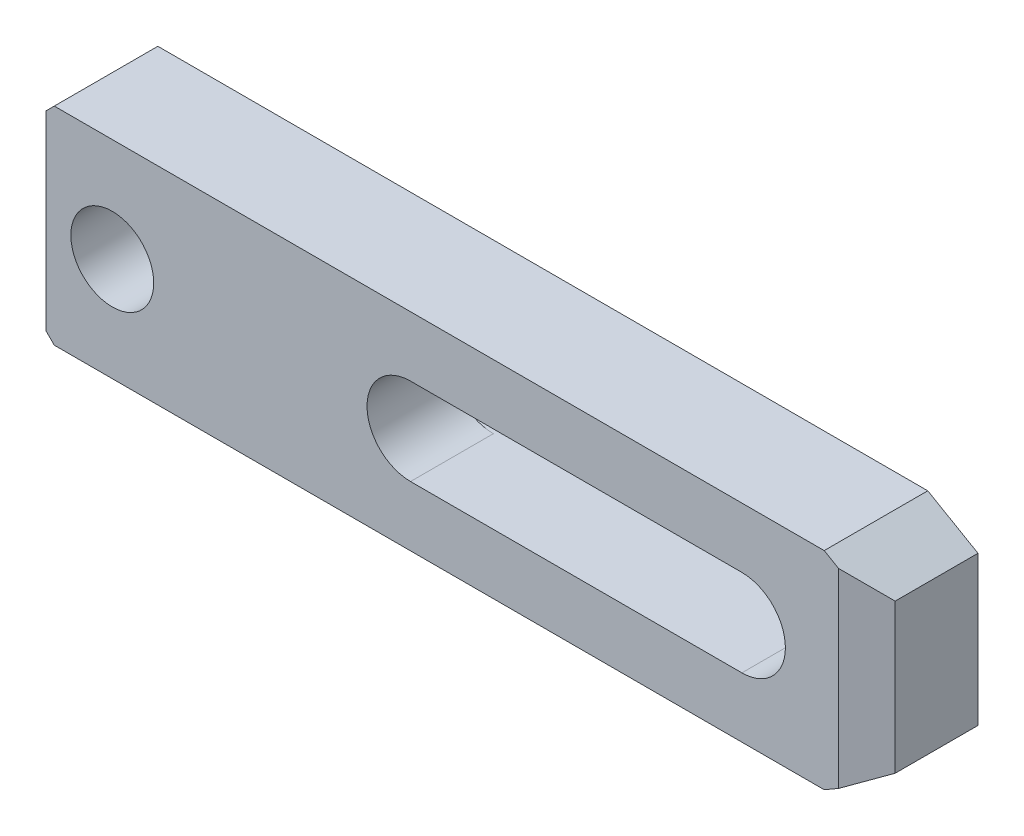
ISO-10303-21;
HEADER;
FILE_DESCRIPTION(('STEP AP214'),'2;1');
FILE_NAME('part.step','',(''),(''),'','','');
FILE_SCHEMA(('AUTOMOTIVE_DESIGN { 1 0 10303 214 1 1 1 1 }'));
ENDSEC;
DATA;
#1=APPLICATION_CONTEXT('core data for automotive mechanical design processes');
#2=APPLICATION_PROTOCOL_DEFINITION('international standard','automotive_design',2000,#1);
#3=PRODUCT_CONTEXT('',#1,'mechanical');
#4=PRODUCT('Part','Part','',(#3));
#5=PRODUCT_RELATED_PRODUCT_CATEGORY('part','',(#4));
#6=PRODUCT_DEFINITION_FORMATION('','',#4);
#7=PRODUCT_DEFINITION_CONTEXT('part definition',#1,'design');
#8=PRODUCT_DEFINITION('design','',#6,#7);
#9=PRODUCT_DEFINITION_SHAPE('','',#8);
#10=(LENGTH_UNIT() NAMED_UNIT(*) SI_UNIT(.MILLI.,.METRE.));
#11=(NAMED_UNIT(*) PLANE_ANGLE_UNIT() SI_UNIT($,.RADIAN.));
#12=(NAMED_UNIT(*) SI_UNIT($,.STERADIAN.) SOLID_ANGLE_UNIT());
#13=UNCERTAINTY_MEASURE_WITH_UNIT(LENGTH_MEASURE(1.E-05),#10,'distance_accuracy_value','');
#14=(GEOMETRIC_REPRESENTATION_CONTEXT(3) GLOBAL_UNCERTAINTY_ASSIGNED_CONTEXT((#13)) GLOBAL_UNIT_ASSIGNED_CONTEXT((#10,
#11,#12)) REPRESENTATION_CONTEXT('',''));
#15=CARTESIAN_POINT('',(0.,0.,0.));
#16=DIRECTION('',(0.,0.,1.));
#17=DIRECTION('',(1.,0.,0.));
#18=AXIS2_PLACEMENT_3D('',#15,#16,#17);
#19=CARTESIAN_POINT('',(-97.9647922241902,93.0352077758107,0.));
#20=DIRECTION('',(0.,0.,1.));
#21=DIRECTION('',(-1.,0.,0.));
#22=AXIS2_PLACEMENT_3D('',#19,#20,#21);
#23=PLANE('',#22);
#24=DIRECTION('',(0.,1.,0.));
#25=VECTOR('',#24,1.);
#26=CARTESIAN_POINT('',(-168.,-23.,0.));
#27=LINE('',#26,#25);
#28=CARTESIAN_POINT('',(-168.,-23.,0.));
#29=VERTEX_POINT('',#28);
#30=CARTESIAN_POINT('',(-168.,-10.5,0.));
#31=VERTEX_POINT('',#30);
#32=EDGE_CURVE('E147',#29,#31,#27,.T.);
#33=ORIENTED_EDGE('',*,*,#32,.T.);
#34=DIRECTION('',(-1.,0.,0.));
#35=VECTOR('',#34,1.);
#36=CARTESIAN_POINT('',(0.,-10.5,0.));
#37=LINE('',#36,#35);
#38=CARTESIAN_POINT('',(0.,-10.5,0.));
#39=VERTEX_POINT('',#38);
#40=EDGE_CURVE('E237',#39,#31,#37,.T.);
#41=ORIENTED_EDGE('',*,*,#40,.F.);
#42=CARTESIAN_POINT('',(0.,0.,0.));
#43=DIRECTION('',(0.,0.,1.));
#44=DIRECTION('',(-1.,0.,0.));
#45=AXIS2_PLACEMENT_3D('',#42,#43,#44);
#46=CIRCLE('',#45,10.5);
#47=CARTESIAN_POINT('',(0.,10.5,0.));
#48=VERTEX_POINT('',#47);
#49=EDGE_CURVE('E128',#39,#48,#46,.T.);
#50=ORIENTED_EDGE('',*,*,#49,.T.);
#51=DIRECTION('',(1.,0.,0.));
#52=VECTOR('',#51,1.);
#53=CARTESIAN_POINT('',(-80.,10.5,0.));
#54=LINE('',#53,#52);
#55=CARTESIAN_POINT('',(-168.,10.5,0.));
#56=VERTEX_POINT('',#55);
#57=EDGE_CURVE('E119',#56,#48,#54,.T.);
#58=ORIENTED_EDGE('',*,*,#57,.F.);
#59=CARTESIAN_POINT('',(-168.,23.,0.));
#60=VERTEX_POINT('',#59);
#61=EDGE_CURVE('E124',#56,#60,#27,.T.);
#62=ORIENTED_EDGE('',*,*,#61,.T.);
#63=DIRECTION('',(-0.707106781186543,-0.707106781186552,0.));
#64=VECTOR('',#63,1.);
#65=CARTESIAN_POINT('',(-166.,25.,0.));
#66=LINE('',#65,#64);
#67=CARTESIAN_POINT('',(-166.,25.,0.));
#68=VERTEX_POINT('',#67);
#69=EDGE_CURVE('E148',#68,#60,#66,.T.);
#70=ORIENTED_EDGE('',*,*,#69,.F.);
#71=DIRECTION('',(-1.,0.,0.));
#72=VECTOR('',#71,1.);
#73=CARTESIAN_POINT('',(19.875644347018,25.,0.));
#74=LINE('',#73,#72);
#75=CARTESIAN_POINT('',(19.875644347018,25.,0.));
#76=VERTEX_POINT('',#75);
#77=EDGE_CURVE('E151',#76,#68,#74,.T.);
#78=ORIENTED_EDGE('',*,*,#77,.F.);
#79=DIRECTION('',(-0.866025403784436,0.5,0.));
#80=VECTOR('',#79,1.);
#81=CARTESIAN_POINT('',(32.,18.,0.));
#82=LINE('',#81,#80);
#83=CARTESIAN_POINT('',(32.,18.,0.));
#84=VERTEX_POINT('',#83);
#85=EDGE_CURVE('E158',#84,#76,#82,.T.);
#86=ORIENTED_EDGE('',*,*,#85,.F.);
#87=DIRECTION('',(0.,-1.,0.));
#88=VECTOR('',#87,1.);
#89=CARTESIAN_POINT('',(32.,18.,0.));
#90=LINE('',#89,#88);
#91=CARTESIAN_POINT('',(32.,-18.,0.));
#92=VERTEX_POINT('',#91);
#93=EDGE_CURVE('E181',#84,#92,#90,.T.);
#94=ORIENTED_EDGE('',*,*,#93,.T.);
#95=DIRECTION('',(-0.86602540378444,-0.5,0.));
#96=VECTOR('',#95,1.);
#97=CARTESIAN_POINT('',(32.,-18.,0.));
#98=LINE('',#97,#96);
#99=CARTESIAN_POINT('',(19.8756443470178,-25.,0.));
#100=VERTEX_POINT('',#99);
#101=EDGE_CURVE('E208',#92,#100,#98,.T.);
#102=ORIENTED_EDGE('',*,*,#101,.T.);
#103=DIRECTION('',(-1.,0.,0.));
#104=VECTOR('',#103,1.);
#105=CARTESIAN_POINT('',(19.8756443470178,-25.,0.));
#106=LINE('',#105,#104);
#107=CARTESIAN_POINT('',(-166.,-25.,0.));
#108=VERTEX_POINT('',#107);
#109=EDGE_CURVE('E210',#100,#108,#106,.T.);
#110=ORIENTED_EDGE('',*,*,#109,.T.);
#111=DIRECTION('',(-0.707106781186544,0.707106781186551,0.));
#112=VECTOR('',#111,1.);
#113=CARTESIAN_POINT('',(-166.,-25.,0.));
#114=LINE('',#113,#112);
#115=EDGE_CURVE('E150',#108,#29,#114,.T.);
#116=ORIENTED_EDGE('',*,*,#115,.T.);
#117=EDGE_LOOP('',(#33,#41,#50,#58,#62,#70,#78,#86,#94,#102,#110,#116));
#118=FACE_BOUND('',#117,.T.);
#119=ADVANCED_FACE('F14',(#118),#23,.F.);
#120=CARTESIAN_POINT('',(-168.,-23.,25.));
#121=DIRECTION('',(-1.,0.,0.));
#122=DIRECTION('',(0.,0.,-1.));
#123=AXIS2_PLACEMENT_3D('',#120,#121,#122);
#124=PLANE('',#123);
#125=DIRECTION('',(0.,-1.,0.));
#126=VECTOR('',#125,1.);
#127=CARTESIAN_POINT('',(-168.,-23.,5.));
#128=LINE('',#127,#126);
#129=CARTESIAN_POINT('',(-168.,10.5,5.));
#130=VERTEX_POINT('',#129);
#131=CARTESIAN_POINT('',(-168.,-10.5,5.));
#132=VERTEX_POINT('',#131);
#133=EDGE_CURVE('E141',#130,#132,#128,.T.);
#134=ORIENTED_EDGE('',*,*,#133,.T.);
#135=DIRECTION('',(0.,0.,-1.));
#136=VECTOR('',#135,1.);
#137=CARTESIAN_POINT('',(-168.,-10.5,25.));
#138=LINE('',#137,#136);
#139=EDGE_CURVE('E140',#132,#31,#138,.T.);
#140=ORIENTED_EDGE('',*,*,#139,.T.);
#141=ORIENTED_EDGE('',*,*,#32,.F.);
#142=DIRECTION('',(0.,0.,-1.));
#143=VECTOR('',#142,1.);
#144=CARTESIAN_POINT('',(-168.,-23.,25.));
#145=LINE('',#144,#143);
#146=CARTESIAN_POINT('',(-168.,-23.,25.));
#147=VERTEX_POINT('',#146);
#148=EDGE_CURVE('E189',#147,#29,#145,.T.);
#149=ORIENTED_EDGE('',*,*,#148,.F.);
#150=DIRECTION('',(0.,1.,0.));
#151=VECTOR('',#150,1.);
#152=CARTESIAN_POINT('',(-168.,-23.,25.));
#153=LINE('',#152,#151);
#154=CARTESIAN_POINT('',(-168.,23.,25.));
#155=VERTEX_POINT('',#154);
#156=EDGE_CURVE('E171',#147,#155,#153,.T.);
#157=ORIENTED_EDGE('',*,*,#156,.T.);
#158=DIRECTION('',(0.,0.,-1.));
#159=VECTOR('',#158,1.);
#160=CARTESIAN_POINT('',(-168.,23.,25.));
#161=LINE('',#160,#159);
#162=EDGE_CURVE('E145',#155,#60,#161,.T.);
#163=ORIENTED_EDGE('',*,*,#162,.T.);
#164=ORIENTED_EDGE('',*,*,#61,.F.);
#165=DIRECTION('',(0.,0.,-1.));
#166=VECTOR('',#165,1.);
#167=CARTESIAN_POINT('',(-168.,10.5,25.));
#168=LINE('',#167,#166);
#169=EDGE_CURVE('E135',#130,#56,#168,.T.);
#170=ORIENTED_EDGE('',*,*,#169,.F.);
#171=EDGE_LOOP('',(#134,#140,#141,#149,#157,#163,#164,#170));
#172=FACE_BOUND('',#171,.T.);
#173=ADVANCED_FACE('F143',(#172),#124,.T.);
#174=CARTESIAN_POINT('',(-152.,0.,25.));
#175=DIRECTION('',(0.,0.,-1.));
#176=DIRECTION('',(1.,0.,0.));
#177=AXIS2_PLACEMENT_3D('',#174,#175,#176);
#178=CYLINDRICAL_SURFACE('',#177,10.);
#179=CARTESIAN_POINT('',(-152.,0.,25.));
#180=DIRECTION('',(0.,0.,1.));
#181=DIRECTION('',(-1.,0.,0.));
#182=AXIS2_PLACEMENT_3D('',#179,#180,#181);
#183=CIRCLE('',#182,10.);
#184=CARTESIAN_POINT('',(-162.,0.,25.));
#185=VERTEX_POINT('',#184);
#186=EDGE_CURVE('E161',#185,#185,#183,.T.);
#187=ORIENTED_EDGE('',*,*,#186,.T.);
#188=EDGE_LOOP('',(#187));
#189=FACE_BOUND('',#188,.T.);
#190=CARTESIAN_POINT('',(-152.,0.,5.));
#191=DIRECTION('',(0.,0.,-1.));
#192=DIRECTION('',(1.,0.,0.));
#193=AXIS2_PLACEMENT_3D('',#190,#191,#192);
#194=CIRCLE('',#193,10.);
#195=CARTESIAN_POINT('',(-142.,0.,5.));
#196=VERTEX_POINT('',#195);
#197=EDGE_CURVE('E425',#196,#196,#194,.T.);
#198=ORIENTED_EDGE('',*,*,#197,.T.);
#199=EDGE_LOOP('',(#198));
#200=FACE_BOUND('',#199,.T.);
#201=ADVANCED_FACE('F262',(#189,#200),#178,.F.);
#202=CARTESIAN_POINT('',(-80.,0.,25.));
#203=DIRECTION('',(0.,0.,-1.));
#204=DIRECTION('',(1.,0.,0.));
#205=AXIS2_PLACEMENT_3D('',#202,#203,#204);
#206=CYLINDRICAL_SURFACE('',#205,10.5);
#207=DIRECTION('',(0.,0.,-1.));
#208=VECTOR('',#207,1.);
#209=CARTESIAN_POINT('',(-80.,-10.5,25.));
#210=LINE('',#209,#208);
#211=CARTESIAN_POINT('',(-80.,-10.5,25.));
#212=VERTEX_POINT('',#211);
#213=CARTESIAN_POINT('',(-80.,-10.5,5.));
#214=VERTEX_POINT('',#213);
#215=EDGE_CURVE('E256',#212,#214,#210,.T.);
#216=ORIENTED_EDGE('',*,*,#215,.T.);
#217=CARTESIAN_POINT('',(-80.,0.,5.));
#218=DIRECTION('',(0.,0.,-1.));
#219=DIRECTION('',(1.,0.,0.));
#220=AXIS2_PLACEMENT_3D('',#217,#218,#219);
#221=CIRCLE('',#220,10.5);
#222=CARTESIAN_POINT('',(-80.,10.5,5.));
#223=VERTEX_POINT('',#222);
#224=EDGE_CURVE('E278',#214,#223,#221,.T.);
#225=ORIENTED_EDGE('',*,*,#224,.T.);
#226=DIRECTION('',(0.,0.,-1.));
#227=VECTOR('',#226,1.);
#228=CARTESIAN_POINT('',(-80.,10.5,25.));
#229=LINE('',#228,#227);
#230=CARTESIAN_POINT('',(-80.,10.5,25.));
#231=VERTEX_POINT('',#230);
#232=EDGE_CURVE('E244',#231,#223,#229,.T.);
#233=ORIENTED_EDGE('',*,*,#232,.F.);
#234=CARTESIAN_POINT('',(-80.,0.,25.));
#235=DIRECTION('',(0.,0.,1.));
#236=DIRECTION('',(-1.,0.,0.));
#237=AXIS2_PLACEMENT_3D('',#234,#235,#236);
#238=CIRCLE('',#237,10.5);
#239=EDGE_CURVE('E132',#231,#212,#238,.T.);
#240=ORIENTED_EDGE('',*,*,#239,.T.);
#241=EDGE_LOOP('',(#216,#225,#233,#240));
#242=FACE_BOUND('',#241,.T.);
#243=ADVANCED_FACE('F269',(#242),#206,.F.);
#244=CARTESIAN_POINT('',(-97.9647922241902,93.0352077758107,25.));
#245=DIRECTION('',(0.,0.,1.));
#246=DIRECTION('',(-1.,0.,0.));
#247=AXIS2_PLACEMENT_3D('',#244,#245,#246);
#248=PLANE('',#247);
#249=DIRECTION('',(0.,-1.,0.));
#250=VECTOR('',#249,1.);
#251=CARTESIAN_POINT('',(23.3397459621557,93.0352077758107,25.));
#252=LINE('',#251,#250);
#253=CARTESIAN_POINT('',(23.3397459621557,23.,25.));
#254=VERTEX_POINT('',#253);
#255=CARTESIAN_POINT('',(23.3397459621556,-23.,25.));
#256=VERTEX_POINT('',#255);
#257=EDGE_CURVE('E233',#254,#256,#252,.T.);
#258=ORIENTED_EDGE('',*,*,#257,.F.);
#259=DIRECTION('',(-0.866025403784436,0.5,0.));
#260=VECTOR('',#259,1.);
#261=CARTESIAN_POINT('',(32.,18.,25.));
#262=LINE('',#261,#260);
#263=CARTESIAN_POINT('',(19.875644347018,25.,25.));
#264=VERTEX_POINT('',#263);
#265=EDGE_CURVE('E179',#254,#264,#262,.T.);
#266=ORIENTED_EDGE('',*,*,#265,.T.);
#267=DIRECTION('',(-1.,0.,0.));
#268=VECTOR('',#267,1.);
#269=CARTESIAN_POINT('',(19.875644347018,25.,25.));
#270=LINE('',#269,#268);
#271=CARTESIAN_POINT('',(-166.,25.,25.));
#272=VERTEX_POINT('',#271);
#273=EDGE_CURVE('E176',#264,#272,#270,.T.);
#274=ORIENTED_EDGE('',*,*,#273,.T.);
#275=DIRECTION('',(-0.707106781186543,-0.707106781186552,0.));
#276=VECTOR('',#275,1.);
#277=CARTESIAN_POINT('',(-166.,25.,25.));
#278=LINE('',#277,#276);
#279=EDGE_CURVE('E173',#272,#155,#278,.T.);
#280=ORIENTED_EDGE('',*,*,#279,.T.);
#281=ORIENTED_EDGE('',*,*,#156,.F.);
#282=DIRECTION('',(-0.707106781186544,0.707106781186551,0.));
#283=VECTOR('',#282,1.);
#284=CARTESIAN_POINT('',(-166.,-25.,25.));
#285=LINE('',#284,#283);
#286=CARTESIAN_POINT('',(-166.,-25.,25.));
#287=VERTEX_POINT('',#286);
#288=EDGE_CURVE('E168',#287,#147,#285,.T.);
#289=ORIENTED_EDGE('',*,*,#288,.F.);
#290=DIRECTION('',(-1.,0.,0.));
#291=VECTOR('',#290,1.);
#292=CARTESIAN_POINT('',(19.8756443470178,-25.,25.));
#293=LINE('',#292,#291);
#294=CARTESIAN_POINT('',(19.8756443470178,-25.,25.));
#295=VERTEX_POINT('',#294);
#296=EDGE_CURVE('E165',#295,#287,#293,.T.);
#297=ORIENTED_EDGE('',*,*,#296,.F.);
#298=DIRECTION('',(-0.86602540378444,-0.5,0.));
#299=VECTOR('',#298,1.);
#300=CARTESIAN_POINT('',(32.,-18.,25.));
#301=LINE('',#300,#299);
#302=EDGE_CURVE('E162',#256,#295,#301,.T.);
#303=ORIENTED_EDGE('',*,*,#302,.F.);
#304=EDGE_LOOP('',(#258,#266,#274,#280,#281,#289,#297,#303));
#305=FACE_BOUND('',#304,.T.);
#306=ORIENTED_EDGE('',*,*,#186,.F.);
#307=EDGE_LOOP('',(#306));
#308=FACE_BOUND('',#307,.T.);
#309=DIRECTION('',(-1.,0.,0.));
#310=VECTOR('',#309,1.);
#311=CARTESIAN_POINT('',(0.,-10.5,25.));
#312=LINE('',#311,#310);
#313=CARTESIAN_POINT('',(0.,-10.5,25.));
#314=VERTEX_POINT('',#313);
#315=EDGE_CURVE('E247',#314,#212,#312,.T.);
#316=ORIENTED_EDGE('',*,*,#315,.T.);
#317=ORIENTED_EDGE('',*,*,#239,.F.);
#318=DIRECTION('',(1.,0.,0.));
#319=VECTOR('',#318,1.);
#320=CARTESIAN_POINT('',(-80.,10.5,25.));
#321=LINE('',#320,#319);
#322=CARTESIAN_POINT('',(0.,10.5,25.));
#323=VERTEX_POINT('',#322);
#324=EDGE_CURVE('E241',#231,#323,#321,.T.);
#325=ORIENTED_EDGE('',*,*,#324,.T.);
#326=CARTESIAN_POINT('',(0.,0.,25.));
#327=DIRECTION('',(0.,0.,1.));
#328=DIRECTION('',(-1.,0.,0.));
#329=AXIS2_PLACEMENT_3D('',#326,#327,#328);
#330=CIRCLE('',#329,10.5);
#331=EDGE_CURVE('E245',#314,#323,#330,.T.);
#332=ORIENTED_EDGE('',*,*,#331,.F.);
#333=EDGE_LOOP('',(#316,#317,#325,#332));
#334=FACE_BOUND('',#333,.T.);
#335=ADVANCED_FACE('F265',(#305,#308,#334),#248,.T.);
#336=CARTESIAN_POINT('',(32.,18.,25.));
#337=DIRECTION('',(-0.5,-0.866025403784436,0.));
#338=DIRECTION('',(0.866025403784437,-0.5,0.));
#339=AXIS2_PLACEMENT_3D('',#336,#337,#338);
#340=PLANE('',#339);
#341=ORIENTED_EDGE('',*,*,#265,.F.);
#342=DIRECTION('',(0.774596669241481,-0.447213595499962,-0.447213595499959));
#343=VECTOR('',#342,1.);
#344=CARTESIAN_POINT('',(30.2679491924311,19.,21.));
#345=LINE('',#344,#343);
#346=CARTESIAN_POINT('',(32.,18.,20.));
#347=VERTEX_POINT('',#346);
#348=EDGE_CURVE('E235',#254,#347,#345,.T.);
#349=ORIENTED_EDGE('',*,*,#348,.T.);
#350=DIRECTION('',(0.,0.,-1.));
#351=VECTOR('',#350,1.);
#352=CARTESIAN_POINT('',(32.,18.,25.));
#353=LINE('',#352,#351);
#354=EDGE_CURVE('E164',#347,#84,#353,.T.);
#355=ORIENTED_EDGE('',*,*,#354,.T.);
#356=ORIENTED_EDGE('',*,*,#85,.T.);
#357=DIRECTION('',(0.,0.,-1.));
#358=VECTOR('',#357,1.);
#359=CARTESIAN_POINT('',(19.875644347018,25.,25.));
#360=LINE('',#359,#358);
#361=EDGE_CURVE('E9',#264,#76,#360,.T.);
#362=ORIENTED_EDGE('',*,*,#361,.F.);
#363=EDGE_LOOP('',(#341,#349,#355,#356,#362));
#364=FACE_BOUND('',#363,.T.);
#365=ADVANCED_FACE('F268',(#364),#340,.F.);
#366=CARTESIAN_POINT('',(19.875644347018,25.,25.));
#367=DIRECTION('',(0.,-1.,0.));
#368=DIRECTION('',(1.,0.,0.));
#369=AXIS2_PLACEMENT_3D('',#366,#367,#368);
#370=PLANE('',#369);
#371=DIRECTION('',(0.,0.,-1.));
#372=VECTOR('',#371,1.);
#373=CARTESIAN_POINT('',(-166.,25.,25.));
#374=LINE('',#373,#372);
#375=EDGE_CURVE('E22',#272,#68,#374,.T.);
#376=ORIENTED_EDGE('',*,*,#375,.F.);
#377=ORIENTED_EDGE('',*,*,#273,.F.);
#378=ORIENTED_EDGE('',*,*,#361,.T.);
#379=ORIENTED_EDGE('',*,*,#77,.T.);
#380=EDGE_LOOP('',(#376,#377,#378,#379));
#381=FACE_BOUND('',#380,.T.);
#382=ADVANCED_FACE('F16',(#381),#370,.F.);
#383=CARTESIAN_POINT('',(-166.,25.,25.));
#384=DIRECTION('',(0.707106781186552,-0.707106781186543,0.));
#385=DIRECTION('',(0.707106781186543,0.707106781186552,0.));
#386=AXIS2_PLACEMENT_3D('',#383,#384,#385);
#387=PLANE('',#386);
#388=ORIENTED_EDGE('',*,*,#162,.F.);
#389=ORIENTED_EDGE('',*,*,#279,.F.);
#390=ORIENTED_EDGE('',*,*,#375,.T.);
#391=ORIENTED_EDGE('',*,*,#69,.T.);
#392=EDGE_LOOP('',(#388,#389,#390,#391));
#393=FACE_BOUND('',#392,.T.);
#394=ADVANCED_FACE('F193',(#393),#387,.F.);
#395=CARTESIAN_POINT('',(-166.,-25.,25.));
#396=DIRECTION('',(-0.707106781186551,-0.707106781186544,0.));
#397=DIRECTION('',(0.707106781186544,-0.707106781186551,0.));
#398=AXIS2_PLACEMENT_3D('',#395,#396,#397);
#399=PLANE('',#398);
#400=DIRECTION('',(0.,0.,-1.));
#401=VECTOR('',#400,1.);
#402=CARTESIAN_POINT('',(-166.,-25.,25.));
#403=LINE('',#402,#401);
#404=EDGE_CURVE('E187',#287,#108,#403,.T.);
#405=ORIENTED_EDGE('',*,*,#404,.F.);
#406=ORIENTED_EDGE('',*,*,#288,.T.);
#407=ORIENTED_EDGE('',*,*,#148,.T.);
#408=ORIENTED_EDGE('',*,*,#115,.F.);
#409=EDGE_LOOP('',(#405,#406,#407,#408));
#410=FACE_BOUND('',#409,.T.);
#411=ADVANCED_FACE('F220',(#410),#399,.T.);
#412=CARTESIAN_POINT('',(19.8756443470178,-25.,25.));
#413=DIRECTION('',(0.,-1.,0.));
#414=DIRECTION('',(1.,0.,0.));
#415=AXIS2_PLACEMENT_3D('',#412,#413,#414);
#416=PLANE('',#415);
#417=DIRECTION('',(0.,0.,-1.));
#418=VECTOR('',#417,1.);
#419=CARTESIAN_POINT('',(19.8756443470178,-25.,25.));
#420=LINE('',#419,#418);
#421=EDGE_CURVE('E185',#295,#100,#420,.T.);
#422=ORIENTED_EDGE('',*,*,#421,.F.);
#423=ORIENTED_EDGE('',*,*,#296,.T.);
#424=ORIENTED_EDGE('',*,*,#404,.T.);
#425=ORIENTED_EDGE('',*,*,#109,.F.);
#426=EDGE_LOOP('',(#422,#423,#424,#425));
#427=FACE_BOUND('',#426,.T.);
#428=ADVANCED_FACE('F306',(#427),#416,.T.);
#429=CARTESIAN_POINT('',(32.,-18.,25.));
#430=DIRECTION('',(0.5,-0.86602540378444,0.));
#431=DIRECTION('',(0.86602540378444,0.5,0.));
#432=AXIS2_PLACEMENT_3D('',#429,#430,#431);
#433=PLANE('',#432);
#434=DIRECTION('',(0.774596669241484,0.447213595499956,-0.44721359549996));
#435=VECTOR('',#434,1.);
#436=CARTESIAN_POINT('',(30.2679491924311,-19.,21.));
#437=LINE('',#436,#435);
#438=CARTESIAN_POINT('',(32.,-18.,20.));
#439=VERTEX_POINT('',#438);
#440=EDGE_CURVE('E37',#256,#439,#437,.T.);
#441=ORIENTED_EDGE('',*,*,#440,.F.);
#442=ORIENTED_EDGE('',*,*,#302,.T.);
#443=ORIENTED_EDGE('',*,*,#421,.T.);
#444=ORIENTED_EDGE('',*,*,#101,.F.);
#445=DIRECTION('',(0.,0.,-1.));
#446=VECTOR('',#445,1.);
#447=CARTESIAN_POINT('',(32.,-18.,25.));
#448=LINE('',#447,#446);
#449=EDGE_CURVE('E183',#439,#92,#448,.T.);
#450=ORIENTED_EDGE('',*,*,#449,.F.);
#451=EDGE_LOOP('',(#441,#442,#443,#444,#450));
#452=FACE_BOUND('',#451,.T.);
#453=ADVANCED_FACE('F303',(#452),#433,.T.);
#454=CARTESIAN_POINT('',(32.,18.,25.));
#455=DIRECTION('',(1.,0.,0.));
#456=DIRECTION('',(0.,0.,1.));
#457=AXIS2_PLACEMENT_3D('',#454,#455,#456);
#458=PLANE('',#457);
#459=DIRECTION('',(0.,-1.,0.));
#460=VECTOR('',#459,1.);
#461=CARTESIAN_POINT('',(32.,25.,20.));
#462=LINE('',#461,#460);
#463=EDGE_CURVE('E227',#347,#439,#462,.T.);
#464=ORIENTED_EDGE('',*,*,#463,.T.);
#465=ORIENTED_EDGE('',*,*,#449,.T.);
#466=ORIENTED_EDGE('',*,*,#93,.F.);
#467=ORIENTED_EDGE('',*,*,#354,.F.);
#468=EDGE_LOOP('',(#464,#465,#466,#467));
#469=FACE_BOUND('',#468,.T.);
#470=ADVANCED_FACE('F205',(#469),#458,.T.);
#471=CARTESIAN_POINT('',(0.,-10.5,25.));
#472=DIRECTION('',(0.,-1.,0.));
#473=DIRECTION('',(1.,0.,0.));
#474=AXIS2_PLACEMENT_3D('',#471,#472,#473);
#475=PLANE('',#474);
#476=ORIENTED_EDGE('',*,*,#40,.T.);
#477=ORIENTED_EDGE('',*,*,#139,.F.);
#478=DIRECTION('',(1.,0.,0.));
#479=VECTOR('',#478,1.);
#480=CARTESIAN_POINT('',(-178.,-10.5,5.));
#481=LINE('',#480,#479);
#482=EDGE_CURVE('E276',#132,#214,#481,.T.);
#483=ORIENTED_EDGE('',*,*,#482,.T.);
#484=ORIENTED_EDGE('',*,*,#215,.F.);
#485=ORIENTED_EDGE('',*,*,#315,.F.);
#486=DIRECTION('',(0.,0.,-1.));
#487=VECTOR('',#486,1.);
#488=CARTESIAN_POINT('',(0.,-10.5,25.));
#489=LINE('',#488,#487);
#490=EDGE_CURVE('E255',#314,#39,#489,.T.);
#491=ORIENTED_EDGE('',*,*,#490,.T.);
#492=EDGE_LOOP('',(#476,#477,#483,#484,#485,#491));
#493=FACE_BOUND('',#492,.T.);
#494=ADVANCED_FACE('F275',(#493),#475,.F.);
#495=CARTESIAN_POINT('',(0.,0.,25.));
#496=DIRECTION('',(0.,0.,-1.));
#497=DIRECTION('',(1.,0.,0.));
#498=AXIS2_PLACEMENT_3D('',#495,#496,#497);
#499=CYLINDRICAL_SURFACE('',#498,10.5);
#500=DIRECTION('',(0.,0.,-1.));
#501=VECTOR('',#500,1.);
#502=CARTESIAN_POINT('',(0.,10.5,25.));
#503=LINE('',#502,#501);
#504=EDGE_CURVE('E253',#323,#48,#503,.T.);
#505=ORIENTED_EDGE('',*,*,#504,.T.);
#506=ORIENTED_EDGE('',*,*,#49,.F.);
#507=ORIENTED_EDGE('',*,*,#490,.F.);
#508=ORIENTED_EDGE('',*,*,#331,.T.);
#509=EDGE_LOOP('',(#505,#506,#507,#508));
#510=FACE_BOUND('',#509,.T.);
#511=ADVANCED_FACE('F280',(#510),#499,.F.);
#512=CARTESIAN_POINT('',(-80.,10.5,25.));
#513=DIRECTION('',(0.,1.,0.));
#514=DIRECTION('',(-1.,0.,0.));
#515=AXIS2_PLACEMENT_3D('',#512,#513,#514);
#516=PLANE('',#515);
#517=ORIENTED_EDGE('',*,*,#57,.T.);
#518=ORIENTED_EDGE('',*,*,#504,.F.);
#519=ORIENTED_EDGE('',*,*,#324,.F.);
#520=ORIENTED_EDGE('',*,*,#232,.T.);
#521=DIRECTION('',(1.,0.,0.));
#522=VECTOR('',#521,1.);
#523=CARTESIAN_POINT('',(-178.,10.5,5.));
#524=LINE('',#523,#522);
#525=EDGE_CURVE('E29',#130,#223,#524,.T.);
#526=ORIENTED_EDGE('',*,*,#525,.F.);
#527=ORIENTED_EDGE('',*,*,#169,.T.);
#528=EDGE_LOOP('',(#517,#518,#519,#520,#526,#527));
#529=FACE_BOUND('',#528,.T.);
#530=ADVANCED_FACE('F136',(#529),#516,.F.);
#531=CARTESIAN_POINT('',(19.875644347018,25.,27.));
#532=DIRECTION('',(-0.5,0.,-0.866025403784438));
#533=DIRECTION('',(0.866025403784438,0.,-0.5));
#534=AXIS2_PLACEMENT_3D('',#531,#532,#533);
#535=PLANE('',#534);
#536=ORIENTED_EDGE('',*,*,#257,.T.);
#537=ORIENTED_EDGE('',*,*,#440,.T.);
#538=ORIENTED_EDGE('',*,*,#463,.F.);
#539=ORIENTED_EDGE('',*,*,#348,.F.);
#540=EDGE_LOOP('',(#536,#537,#538,#539));
#541=FACE_BOUND('',#540,.T.);
#542=ADVANCED_FACE('F288',(#541),#535,.F.);
#543=CARTESIAN_POINT('',(-178.,10.5,5.));
#544=DIRECTION('',(0.,0.,-1.));
#545=DIRECTION('',(1.,0.,0.));
#546=AXIS2_PLACEMENT_3D('',#543,#544,#545);
#547=PLANE('',#546);
#548=ORIENTED_EDGE('',*,*,#197,.F.);
#549=EDGE_LOOP('',(#548));
#550=FACE_BOUND('',#549,.T.);
#551=ORIENTED_EDGE('',*,*,#525,.T.);
#552=ORIENTED_EDGE('',*,*,#224,.F.);
#553=ORIENTED_EDGE('',*,*,#482,.F.);
#554=ORIENTED_EDGE('',*,*,#133,.F.);
#555=EDGE_LOOP('',(#551,#552,#553,#554));
#556=FACE_BOUND('',#555,.T.);
#557=ADVANCED_FACE('F410',(#550,#556),#547,.T.);
#558=CLOSED_SHELL('',(#119,#173,#201,#243,#335,#365,#382,#394,#411,#428,#453,#470,#494,#511,
#530,#542,#557));
#559=MANIFOLD_SOLID_BREP('B1',#558);
#560=ADVANCED_BREP_SHAPE_REPRESENTATION('',(#18,#559),#14);
#561=SHAPE_DEFINITION_REPRESENTATION(#9,#560);
ENDSEC;
END-ISO-10303-21;
